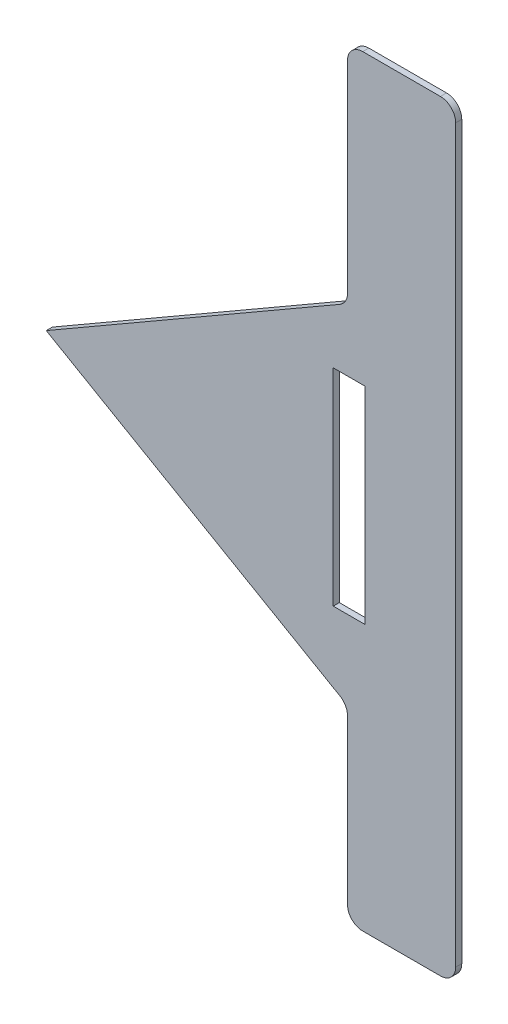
ISO-10303-21;
HEADER;
FILE_DESCRIPTION(('STEP AP214'),'2;1');
FILE_NAME('part.step','',(''),(''),'','','');
FILE_SCHEMA(('AUTOMOTIVE_DESIGN { 1 0 10303 214 1 1 1 1 }'));
ENDSEC;
DATA;
#1=APPLICATION_CONTEXT('core data for automotive mechanical design processes');
#2=APPLICATION_PROTOCOL_DEFINITION('international standard','automotive_design',2000,#1);
#3=PRODUCT_CONTEXT('',#1,'mechanical');
#4=PRODUCT('Part','Part','',(#3));
#5=PRODUCT_RELATED_PRODUCT_CATEGORY('part','',(#4));
#6=PRODUCT_DEFINITION_FORMATION('','',#4);
#7=PRODUCT_DEFINITION_CONTEXT('part definition',#1,'design');
#8=PRODUCT_DEFINITION('design','',#6,#7);
#9=PRODUCT_DEFINITION_SHAPE('','',#8);
#10=(LENGTH_UNIT() NAMED_UNIT(*) SI_UNIT(.MILLI.,.METRE.));
#11=(NAMED_UNIT(*) PLANE_ANGLE_UNIT() SI_UNIT($,.RADIAN.));
#12=(NAMED_UNIT(*) SI_UNIT($,.STERADIAN.) SOLID_ANGLE_UNIT());
#13=UNCERTAINTY_MEASURE_WITH_UNIT(LENGTH_MEASURE(1.E-05),#10,'distance_accuracy_value','');
#14=(GEOMETRIC_REPRESENTATION_CONTEXT(3) GLOBAL_UNCERTAINTY_ASSIGNED_CONTEXT((#13)) GLOBAL_UNIT_ASSIGNED_CONTEXT((#10,
#11,#12)) REPRESENTATION_CONTEXT('',''));
#15=CARTESIAN_POINT('',(0.,0.,0.));
#16=DIRECTION('',(0.,0.,1.));
#17=DIRECTION('',(1.,0.,0.));
#18=AXIS2_PLACEMENT_3D('',#15,#16,#17);
#19=CARTESIAN_POINT('',(0.,0.,-0.8));
#20=DIRECTION('',(0.,0.,-1.));
#21=DIRECTION('',(-1.,0.,0.));
#22=AXIS2_PLACEMENT_3D('',#19,#20,#21);
#23=PLANE('',#22);
#24=DIRECTION('',(1.,0.,0.));
#25=VECTOR('',#24,1.);
#26=CARTESIAN_POINT('',(-15.0000000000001,100.,-0.8));
#27=LINE('',#26,#25);
#28=CARTESIAN_POINT('',(-2.80000000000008,100.,-0.8));
#29=VERTEX_POINT('',#28);
#30=CARTESIAN_POINT('',(-13.0000000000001,100.,-0.8));
#31=VERTEX_POINT('',#30);
#32=EDGE_CURVE('E196',#29,#31,#27,.F.);
#33=ORIENTED_EDGE('',*,*,#32,.F.);
#34=CARTESIAN_POINT('',(-2.80000000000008,98.,-0.8));
#35=DIRECTION('',(0.,0.,1.));
#36=DIRECTION('',(1.,0.,0.));
#37=AXIS2_PLACEMENT_3D('',#34,#35,#36);
#38=CIRCLE('',#37,2.);
#39=CARTESIAN_POINT('',(-0.800000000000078,98.,-0.8));
#40=VERTEX_POINT('',#39);
#41=EDGE_CURVE('E233',#40,#29,#38,.T.);
#42=ORIENTED_EDGE('',*,*,#41,.F.);
#43=DIRECTION('',(0.,1.,0.));
#44=VECTOR('',#43,1.);
#45=CARTESIAN_POINT('',(-0.800000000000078,0.,-0.8));
#46=LINE('',#45,#44);
#47=CARTESIAN_POINT('',(-0.800000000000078,2.,-0.8));
#48=VERTEX_POINT('',#47);
#49=EDGE_CURVE('E192',#48,#40,#46,.T.);
#50=ORIENTED_EDGE('',*,*,#49,.F.);
#51=CARTESIAN_POINT('',(-2.80000000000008,2.,-0.8));
#52=DIRECTION('',(0.,0.,1.));
#53=DIRECTION('',(1.,0.,0.));
#54=AXIS2_PLACEMENT_3D('',#51,#52,#53);
#55=CIRCLE('',#54,2.);
#56=CARTESIAN_POINT('',(-2.80000000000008,0.,-0.8));
#57=VERTEX_POINT('',#56);
#58=EDGE_CURVE('E231',#57,#48,#55,.T.);
#59=ORIENTED_EDGE('',*,*,#58,.F.);
#60=DIRECTION('',(1.,0.,0.));
#61=VECTOR('',#60,1.);
#62=CARTESIAN_POINT('',(-0.800000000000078,0.,-0.8));
#63=LINE('',#62,#61);
#64=CARTESIAN_POINT('',(-13.0000000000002,0.,-0.8));
#65=VERTEX_POINT('',#64);
#66=EDGE_CURVE('E189',#65,#57,#63,.T.);
#67=ORIENTED_EDGE('',*,*,#66,.F.);
#68=CARTESIAN_POINT('',(-13.0000000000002,2.,-0.8));
#69=DIRECTION('',(0.,0.,1.));
#70=DIRECTION('',(1.,0.,0.));
#71=AXIS2_PLACEMENT_3D('',#68,#69,#70);
#72=CIRCLE('',#71,2.);
#73=CARTESIAN_POINT('',(-15.0000000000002,2.,-0.8));
#74=VERTEX_POINT('',#73);
#75=EDGE_CURVE('E20',#74,#65,#72,.T.);
#76=ORIENTED_EDGE('',*,*,#75,.F.);
#77=DIRECTION('',(0.,1.,0.));
#78=VECTOR('',#77,1.);
#79=CARTESIAN_POINT('',(-15.0000000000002,0.,-0.8));
#80=LINE('',#79,#78);
#81=CARTESIAN_POINT('',(-15.0000000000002,23.5071796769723,-0.8));
#82=VERTEX_POINT('',#81);
#83=EDGE_CURVE('E107',#82,#74,#80,.F.);
#84=ORIENTED_EDGE('',*,*,#83,.F.);
#85=CARTESIAN_POINT('',(-17.0000000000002,23.5071796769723,-0.8));
#86=DIRECTION('',(0.,0.,-1.));
#87=DIRECTION('',(-1.,0.,0.));
#88=AXIS2_PLACEMENT_3D('',#85,#86,#87);
#89=CIRCLE('',#88,2.);
#90=CARTESIAN_POINT('',(-16.0000000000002,25.2392304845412,-0.8));
#91=VERTEX_POINT('',#90);
#92=EDGE_CURVE('E150',#82,#91,#89,.F.);
#93=ORIENTED_EDGE('',*,*,#92,.T.);
#94=DIRECTION('',(0.866025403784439,-0.5,0.));
#95=VECTOR('',#94,1.);
#96=CARTESIAN_POINT('',(-15.0000000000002,24.6618802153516,-0.8));
#97=LINE('',#96,#95);
#98=CARTESIAN_POINT('',(-54.5567838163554,47.5000000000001,-0.8));
#99=VERTEX_POINT('',#98);
#100=EDGE_CURVE('E147',#99,#91,#97,.T.);
#101=ORIENTED_EDGE('',*,*,#100,.F.);
#102=DIRECTION('',(-0.866025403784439,-0.5,0.));
#103=VECTOR('',#102,1.);
#104=CARTESIAN_POINT('',(-54.5567838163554,47.5000000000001,-0.8));
#105=LINE('',#104,#103);
#106=CARTESIAN_POINT('',(-16.0000000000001,69.760769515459,-0.8));
#107=VERTEX_POINT('',#106);
#108=EDGE_CURVE('E133',#107,#99,#105,.T.);
#109=ORIENTED_EDGE('',*,*,#108,.F.);
#110=CARTESIAN_POINT('',(-17.0000000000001,71.4928203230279,-0.8));
#111=DIRECTION('',(0.,0.,-1.));
#112=DIRECTION('',(-1.,0.,0.));
#113=AXIS2_PLACEMENT_3D('',#110,#111,#112);
#114=CIRCLE('',#113,2.);
#115=CARTESIAN_POINT('',(-15.0000000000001,71.4928203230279,-0.8));
#116=VERTEX_POINT('',#115);
#117=EDGE_CURVE('E159',#107,#116,#114,.F.);
#118=ORIENTED_EDGE('',*,*,#117,.T.);
#119=DIRECTION('',(0.,-1.,0.));
#120=VECTOR('',#119,1.);
#121=CARTESIAN_POINT('',(-15.0000000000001,70.3381197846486,-0.8));
#122=LINE('',#121,#120);
#123=CARTESIAN_POINT('',(-15.0000000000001,98.,-0.8));
#124=VERTEX_POINT('',#123);
#125=EDGE_CURVE('E200',#124,#116,#122,.T.);
#126=ORIENTED_EDGE('',*,*,#125,.F.);
#127=CARTESIAN_POINT('',(-13.0000000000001,98.,-0.8));
#128=DIRECTION('',(0.,0.,1.));
#129=DIRECTION('',(1.,0.,0.));
#130=AXIS2_PLACEMENT_3D('',#127,#128,#129);
#131=CIRCLE('',#130,2.);
#132=EDGE_CURVE('E235',#31,#124,#131,.T.);
#133=ORIENTED_EDGE('',*,*,#132,.F.);
#134=EDGE_LOOP('',(#33,#42,#50,#59,#67,#76,#84,#93,#101,#109,#118,#126,#133));
#135=FACE_BOUND('',#134,.T.);
#136=DIRECTION('',(1.,0.,0.));
#137=VECTOR('',#136,1.);
#138=CARTESIAN_POINT('',(-16.874669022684,35.0092429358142,-0.8));
#139=LINE('',#138,#137);
#140=CARTESIAN_POINT('',(-16.874669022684,35.0092429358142,-0.8));
#141=VERTEX_POINT('',#140);
#142=CARTESIAN_POINT('',(-12.7110477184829,35.0092429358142,-0.8));
#143=VERTEX_POINT('',#142);
#144=EDGE_CURVE('E187',#141,#143,#139,.T.);
#145=ORIENTED_EDGE('',*,*,#144,.T.);
#146=DIRECTION('',(0.,1.,0.));
#147=VECTOR('',#146,1.);
#148=CARTESIAN_POINT('',(-12.7110477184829,35.0092429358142,-0.8));
#149=LINE('',#148,#147);
#150=CARTESIAN_POINT('',(-12.7110477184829,62.1056181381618,-0.8));
#151=VERTEX_POINT('',#150);
#152=EDGE_CURVE('E182',#143,#151,#149,.T.);
#153=ORIENTED_EDGE('',*,*,#152,.T.);
#154=DIRECTION('',(1.,0.,0.));
#155=VECTOR('',#154,1.);
#156=CARTESIAN_POINT('',(-12.7110477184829,62.1056181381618,-0.8));
#157=LINE('',#156,#155);
#158=CARTESIAN_POINT('',(-16.874669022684,62.1056181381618,-0.8));
#159=VERTEX_POINT('',#158);
#160=EDGE_CURVE('E116',#151,#159,#157,.F.);
#161=ORIENTED_EDGE('',*,*,#160,.T.);
#162=DIRECTION('',(0.,1.,0.));
#163=VECTOR('',#162,1.);
#164=CARTESIAN_POINT('',(-16.874669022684,62.1056181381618,-0.8));
#165=LINE('',#164,#163);
#166=EDGE_CURVE('E170',#159,#141,#165,.F.);
#167=ORIENTED_EDGE('',*,*,#166,.T.);
#168=EDGE_LOOP('',(#145,#153,#161,#167));
#169=FACE_BOUND('',#168,.T.);
#170=ADVANCED_FACE('F17',(#135,#169),#23,.T.);
#171=CARTESIAN_POINT('',(-16.874669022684,35.0092429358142,-10.));
#172=DIRECTION('',(0.,-1.,0.));
#173=DIRECTION('',(0.,0.,-1.));
#174=AXIS2_PLACEMENT_3D('',#171,#172,#173);
#175=PLANE('',#174);
#176=DIRECTION('',(0.,0.,1.));
#177=VECTOR('',#176,1.);
#178=CARTESIAN_POINT('',(-16.874669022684,35.0092429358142,-10.));
#179=LINE('',#178,#177);
#180=CARTESIAN_POINT('',(-16.874669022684,35.0092429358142,0.));
#181=VERTEX_POINT('',#180);
#182=EDGE_CURVE('E175',#141,#181,#179,.T.);
#183=ORIENTED_EDGE('',*,*,#182,.T.);
#184=DIRECTION('',(-1.,0.,0.));
#185=VECTOR('',#184,1.);
#186=CARTESIAN_POINT('',(0.,35.0092429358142,0.));
#187=LINE('',#186,#185);
#188=CARTESIAN_POINT('',(-12.7110477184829,35.0092429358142,0.));
#189=VERTEX_POINT('',#188);
#190=EDGE_CURVE('E256',#181,#189,#187,.F.);
#191=ORIENTED_EDGE('',*,*,#190,.T.);
#192=DIRECTION('',(0.,0.,-1.));
#193=VECTOR('',#192,1.);
#194=CARTESIAN_POINT('',(-12.7110477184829,35.0092429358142,-10.));
#195=LINE('',#194,#193);
#196=EDGE_CURVE('E184',#189,#143,#195,.T.);
#197=ORIENTED_EDGE('',*,*,#196,.T.);
#198=ORIENTED_EDGE('',*,*,#144,.F.);
#199=EDGE_LOOP('',(#183,#191,#197,#198));
#200=FACE_BOUND('',#199,.T.);
#201=ADVANCED_FACE('F460',(#200),#175,.F.);
#202=CARTESIAN_POINT('',(-12.7110477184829,35.0092429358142,-10.));
#203=DIRECTION('',(1.,0.,0.));
#204=DIRECTION('',(0.,0.,-1.));
#205=AXIS2_PLACEMENT_3D('',#202,#203,#204);
#206=PLANE('',#205);
#207=ORIENTED_EDGE('',*,*,#196,.F.);
#208=DIRECTION('',(0.,1.,0.));
#209=VECTOR('',#208,1.);
#210=CARTESIAN_POINT('',(-12.7110477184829,0.,0.));
#211=LINE('',#210,#209);
#212=CARTESIAN_POINT('',(-12.7110477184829,62.1056181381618,0.));
#213=VERTEX_POINT('',#212);
#214=EDGE_CURVE('E260',#189,#213,#211,.T.);
#215=ORIENTED_EDGE('',*,*,#214,.T.);
#216=DIRECTION('',(0.,0.,1.));
#217=VECTOR('',#216,1.);
#218=CARTESIAN_POINT('',(-12.7110477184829,62.1056181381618,-10.));
#219=LINE('',#218,#217);
#220=EDGE_CURVE('E179',#213,#151,#219,.F.);
#221=ORIENTED_EDGE('',*,*,#220,.T.);
#222=ORIENTED_EDGE('',*,*,#152,.F.);
#223=EDGE_LOOP('',(#207,#215,#221,#222));
#224=FACE_BOUND('',#223,.T.);
#225=ADVANCED_FACE('F450',(#224),#206,.F.);
#226=CARTESIAN_POINT('',(-12.7110477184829,62.1056181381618,-10.));
#227=DIRECTION('',(0.,1.,0.));
#228=DIRECTION('',(0.,0.,1.));
#229=AXIS2_PLACEMENT_3D('',#226,#227,#228);
#230=PLANE('',#229);
#231=ORIENTED_EDGE('',*,*,#220,.F.);
#232=DIRECTION('',(-1.,0.,0.));
#233=VECTOR('',#232,1.);
#234=CARTESIAN_POINT('',(0.,62.1056181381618,0.));
#235=LINE('',#234,#233);
#236=CARTESIAN_POINT('',(-16.874669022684,62.1056181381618,0.));
#237=VERTEX_POINT('',#236);
#238=EDGE_CURVE('E263',#213,#237,#235,.T.);
#239=ORIENTED_EDGE('',*,*,#238,.T.);
#240=DIRECTION('',(0.,0.,1.));
#241=VECTOR('',#240,1.);
#242=CARTESIAN_POINT('',(-16.874669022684,62.1056181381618,-10.));
#243=LINE('',#242,#241);
#244=EDGE_CURVE('E172',#237,#159,#243,.F.);
#245=ORIENTED_EDGE('',*,*,#244,.T.);
#246=ORIENTED_EDGE('',*,*,#160,.F.);
#247=EDGE_LOOP('',(#231,#239,#245,#246));
#248=FACE_BOUND('',#247,.T.);
#249=ADVANCED_FACE('F440',(#248),#230,.F.);
#250=CARTESIAN_POINT('',(-16.874669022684,62.1056181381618,-10.));
#251=DIRECTION('',(-1.,0.,0.));
#252=DIRECTION('',(0.,0.,1.));
#253=AXIS2_PLACEMENT_3D('',#250,#251,#252);
#254=PLANE('',#253);
#255=ORIENTED_EDGE('',*,*,#244,.F.);
#256=DIRECTION('',(0.,1.,0.));
#257=VECTOR('',#256,1.);
#258=CARTESIAN_POINT('',(-16.874669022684,0.,0.));
#259=LINE('',#258,#257);
#260=EDGE_CURVE('E230',#237,#181,#259,.F.);
#261=ORIENTED_EDGE('',*,*,#260,.T.);
#262=ORIENTED_EDGE('',*,*,#182,.F.);
#263=ORIENTED_EDGE('',*,*,#166,.F.);
#264=EDGE_LOOP('',(#255,#261,#262,#263));
#265=FACE_BOUND('',#264,.T.);
#266=ADVANCED_FACE('F431',(#265),#254,.F.);
#267=CARTESIAN_POINT('',(-13.0000000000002,2.,-0.8));
#268=DIRECTION('',(0.,0.,1.));
#269=DIRECTION('',(1.,0.,0.));
#270=AXIS2_PLACEMENT_3D('',#267,#268,#269);
#271=CYLINDRICAL_SURFACE('',#270,2.);
#272=CARTESIAN_POINT('',(-13.0000000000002,2.,0.));
#273=DIRECTION('',(0.,0.,1.));
#274=DIRECTION('',(1.,0.,0.));
#275=AXIS2_PLACEMENT_3D('',#272,#273,#274);
#276=CIRCLE('',#275,2.);
#277=CARTESIAN_POINT('',(-13.0000000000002,0.,0.));
#278=VERTEX_POINT('',#277);
#279=CARTESIAN_POINT('',(-15.0000000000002,2.,0.));
#280=VERTEX_POINT('',#279);
#281=EDGE_CURVE('E227',#278,#280,#276,.F.);
#282=ORIENTED_EDGE('',*,*,#281,.T.);
#283=DIRECTION('',(0.,0.,1.));
#284=VECTOR('',#283,1.);
#285=CARTESIAN_POINT('',(-15.0000000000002,2.,-0.8));
#286=LINE('',#285,#284);
#287=EDGE_CURVE('E168',#74,#280,#286,.T.);
#288=ORIENTED_EDGE('',*,*,#287,.F.);
#289=ORIENTED_EDGE('',*,*,#75,.T.);
#290=DIRECTION('',(0.,0.,1.));
#291=VECTOR('',#290,1.);
#292=CARTESIAN_POINT('',(-13.0000000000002,0.,-0.8));
#293=LINE('',#292,#291);
#294=EDGE_CURVE('E253',#278,#65,#293,.F.);
#295=ORIENTED_EDGE('',*,*,#294,.F.);
#296=EDGE_LOOP('',(#282,#288,#289,#295));
#297=FACE_BOUND('',#296,.T.);
#298=ADVANCED_FACE('F310',(#297),#271,.T.);
#299=CARTESIAN_POINT('',(-15.0000000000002,0.,-0.8));
#300=DIRECTION('',(-1.,0.,0.));
#301=DIRECTION('',(0.,0.,1.));
#302=AXIS2_PLACEMENT_3D('',#299,#300,#301);
#303=PLANE('',#302);
#304=DIRECTION('',(0.,1.,0.));
#305=VECTOR('',#304,1.);
#306=CARTESIAN_POINT('',(-15.0000000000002,0.,0.));
#307=LINE('',#306,#305);
#308=CARTESIAN_POINT('',(-15.0000000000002,23.5071796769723,0.));
#309=VERTEX_POINT('',#308);
#310=EDGE_CURVE('E226',#280,#309,#307,.T.);
#311=ORIENTED_EDGE('',*,*,#310,.T.);
#312=DIRECTION('',(0.,0.,-1.));
#313=VECTOR('',#312,1.);
#314=CARTESIAN_POINT('',(-15.0000000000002,23.5071796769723,-0.8));
#315=LINE('',#314,#313);
#316=EDGE_CURVE('E166',#309,#82,#315,.T.);
#317=ORIENTED_EDGE('',*,*,#316,.T.);
#318=ORIENTED_EDGE('',*,*,#83,.T.);
#319=ORIENTED_EDGE('',*,*,#287,.T.);
#320=EDGE_LOOP('',(#311,#317,#318,#319));
#321=FACE_BOUND('',#320,.T.);
#322=ADVANCED_FACE('F306',(#321),#303,.T.);
#323=CARTESIAN_POINT('',(-17.0000000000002,23.5071796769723,-0.8));
#324=DIRECTION('',(0.,0.,-1.));
#325=DIRECTION('',(-1.,0.,0.));
#326=AXIS2_PLACEMENT_3D('',#323,#324,#325);
#327=CYLINDRICAL_SURFACE('',#326,2.);
#328=ORIENTED_EDGE('',*,*,#316,.F.);
#329=CARTESIAN_POINT('',(-17.0000000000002,23.5071796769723,0.));
#330=DIRECTION('',(0.,0.,-1.));
#331=DIRECTION('',(-1.,0.,0.));
#332=AXIS2_PLACEMENT_3D('',#329,#330,#331);
#333=CIRCLE('',#332,2.);
#334=CARTESIAN_POINT('',(-16.0000000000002,25.2392304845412,0.));
#335=VERTEX_POINT('',#334);
#336=EDGE_CURVE('E223',#309,#335,#333,.F.);
#337=ORIENTED_EDGE('',*,*,#336,.T.);
#338=DIRECTION('',(0.,0.,1.));
#339=VECTOR('',#338,1.);
#340=CARTESIAN_POINT('',(-16.0000000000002,25.2392304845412,-0.8));
#341=LINE('',#340,#339);
#342=EDGE_CURVE('E144',#91,#335,#341,.T.);
#343=ORIENTED_EDGE('',*,*,#342,.F.);
#344=ORIENTED_EDGE('',*,*,#92,.F.);
#345=EDGE_LOOP('',(#328,#337,#343,#344));
#346=FACE_BOUND('',#345,.T.);
#347=ADVANCED_FACE('F305',(#346),#327,.F.);
#348=CARTESIAN_POINT('',(-15.0000000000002,24.6618802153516,-0.8));
#349=DIRECTION('',(-0.5,-0.866025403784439,0.));
#350=DIRECTION('',(0.866025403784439,-0.5,0.));
#351=AXIS2_PLACEMENT_3D('',#348,#349,#350);
#352=PLANE('',#351);
#353=DIRECTION('',(-0.866025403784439,0.5,0.));
#354=VECTOR('',#353,1.);
#355=CARTESIAN_POINT('',(-16.0000000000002,25.2392304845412,0.));
#356=LINE('',#355,#354);
#357=CARTESIAN_POINT('',(-54.5567838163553,47.5000000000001,0.));
#358=VERTEX_POINT('',#357);
#359=EDGE_CURVE('E157',#335,#358,#356,.T.);
#360=ORIENTED_EDGE('',*,*,#359,.T.);
#361=DIRECTION('',(0.,0.,1.));
#362=VECTOR('',#361,1.);
#363=CARTESIAN_POINT('',(-54.5567838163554,47.5000000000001,-0.8));
#364=LINE('',#363,#362);
#365=EDGE_CURVE('E138',#99,#358,#364,.T.);
#366=ORIENTED_EDGE('',*,*,#365,.F.);
#367=ORIENTED_EDGE('',*,*,#100,.T.);
#368=ORIENTED_EDGE('',*,*,#342,.T.);
#369=EDGE_LOOP('',(#360,#366,#367,#368));
#370=FACE_BOUND('',#369,.T.);
#371=ADVANCED_FACE('F155',(#370),#352,.T.);
#372=CARTESIAN_POINT('',(-54.5567838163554,47.5000000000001,-0.8));
#373=DIRECTION('',(-0.5,0.866025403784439,0.));
#374=DIRECTION('',(-0.866025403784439,-0.5,0.));
#375=AXIS2_PLACEMENT_3D('',#372,#373,#374);
#376=PLANE('',#375);
#377=ORIENTED_EDGE('',*,*,#108,.T.);
#378=ORIENTED_EDGE('',*,*,#365,.T.);
#379=DIRECTION('',(0.866025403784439,0.5,0.));
#380=VECTOR('',#379,1.);
#381=CARTESIAN_POINT('',(-54.5567838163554,47.5000000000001,0.));
#382=LINE('',#381,#380);
#383=CARTESIAN_POINT('',(-16.0000000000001,69.760769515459,0.));
#384=VERTEX_POINT('',#383);
#385=EDGE_CURVE('E222',#358,#384,#382,.T.);
#386=ORIENTED_EDGE('',*,*,#385,.T.);
#387=DIRECTION('',(0.,0.,-1.));
#388=VECTOR('',#387,1.);
#389=CARTESIAN_POINT('',(-16.0000000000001,69.760769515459,-0.8));
#390=LINE('',#389,#388);
#391=EDGE_CURVE('E140',#384,#107,#390,.T.);
#392=ORIENTED_EDGE('',*,*,#391,.T.);
#393=EDGE_LOOP('',(#377,#378,#386,#392));
#394=FACE_BOUND('',#393,.T.);
#395=ADVANCED_FACE('F135',(#394),#376,.T.);
#396=CARTESIAN_POINT('',(-17.0000000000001,71.4928203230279,-0.8));
#397=DIRECTION('',(0.,0.,-1.));
#398=DIRECTION('',(-1.,0.,0.));
#399=AXIS2_PLACEMENT_3D('',#396,#397,#398);
#400=CYLINDRICAL_SURFACE('',#399,2.);
#401=ORIENTED_EDGE('',*,*,#391,.F.);
#402=CARTESIAN_POINT('',(-17.0000000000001,71.4928203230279,0.));
#403=DIRECTION('',(0.,0.,-1.));
#404=DIRECTION('',(-1.,0.,0.));
#405=AXIS2_PLACEMENT_3D('',#402,#403,#404);
#406=CIRCLE('',#405,2.);
#407=CARTESIAN_POINT('',(-15.0000000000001,71.4928203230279,0.));
#408=VERTEX_POINT('',#407);
#409=EDGE_CURVE('E219',#384,#408,#406,.F.);
#410=ORIENTED_EDGE('',*,*,#409,.T.);
#411=DIRECTION('',(0.,0.,1.));
#412=VECTOR('',#411,1.);
#413=CARTESIAN_POINT('',(-15.0000000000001,71.4928203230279,-0.8));
#414=LINE('',#413,#412);
#415=EDGE_CURVE('E201',#116,#408,#414,.T.);
#416=ORIENTED_EDGE('',*,*,#415,.F.);
#417=ORIENTED_EDGE('',*,*,#117,.F.);
#418=EDGE_LOOP('',(#401,#410,#416,#417));
#419=FACE_BOUND('',#418,.T.);
#420=ADVANCED_FACE('F242',(#419),#400,.F.);
#421=CARTESIAN_POINT('',(-15.0000000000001,70.3381197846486,-0.8));
#422=DIRECTION('',(-1.,0.,0.));
#423=DIRECTION('',(0.,-1.,0.));
#424=AXIS2_PLACEMENT_3D('',#421,#422,#423);
#425=PLANE('',#424);
#426=DIRECTION('',(0.,1.,0.));
#427=VECTOR('',#426,1.);
#428=CARTESIAN_POINT('',(-15.0000000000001,0.,0.));
#429=LINE('',#428,#427);
#430=CARTESIAN_POINT('',(-15.0000000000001,98.,0.));
#431=VERTEX_POINT('',#430);
#432=EDGE_CURVE('E218',#408,#431,#429,.T.);
#433=ORIENTED_EDGE('',*,*,#432,.T.);
#434=DIRECTION('',(0.,0.,1.));
#435=VECTOR('',#434,1.);
#436=CARTESIAN_POINT('',(-15.0000000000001,98.,-0.8));
#437=LINE('',#436,#435);
#438=EDGE_CURVE('E199',#124,#431,#437,.T.);
#439=ORIENTED_EDGE('',*,*,#438,.F.);
#440=ORIENTED_EDGE('',*,*,#125,.T.);
#441=ORIENTED_EDGE('',*,*,#415,.T.);
#442=EDGE_LOOP('',(#433,#439,#440,#441));
#443=FACE_BOUND('',#442,.T.);
#444=ADVANCED_FACE('F301',(#443),#425,.T.);
#445=CARTESIAN_POINT('',(-13.0000000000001,98.,-0.8));
#446=DIRECTION('',(0.,0.,1.));
#447=DIRECTION('',(1.,0.,0.));
#448=AXIS2_PLACEMENT_3D('',#445,#446,#447);
#449=CYLINDRICAL_SURFACE('',#448,2.);
#450=CARTESIAN_POINT('',(-13.0000000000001,98.,0.));
#451=DIRECTION('',(0.,0.,1.));
#452=DIRECTION('',(1.,0.,0.));
#453=AXIS2_PLACEMENT_3D('',#450,#451,#452);
#454=CIRCLE('',#453,2.);
#455=CARTESIAN_POINT('',(-13.0000000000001,100.,0.));
#456=VERTEX_POINT('',#455);
#457=EDGE_CURVE('E215',#431,#456,#454,.F.);
#458=ORIENTED_EDGE('',*,*,#457,.T.);
#459=DIRECTION('',(0.,0.,1.));
#460=VECTOR('',#459,1.);
#461=CARTESIAN_POINT('',(-13.0000000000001,100.,-0.8));
#462=LINE('',#461,#460);
#463=EDGE_CURVE('E198',#31,#456,#462,.T.);
#464=ORIENTED_EDGE('',*,*,#463,.F.);
#465=ORIENTED_EDGE('',*,*,#132,.T.);
#466=ORIENTED_EDGE('',*,*,#438,.T.);
#467=EDGE_LOOP('',(#458,#464,#465,#466));
#468=FACE_BOUND('',#467,.T.);
#469=ADVANCED_FACE('F300',(#468),#449,.T.);
#470=CARTESIAN_POINT('',(-15.0000000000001,100.,-0.8));
#471=DIRECTION('',(0.,1.,0.));
#472=DIRECTION('',(0.,0.,1.));
#473=AXIS2_PLACEMENT_3D('',#470,#471,#472);
#474=PLANE('',#473);
#475=DIRECTION('',(-1.,0.,0.));
#476=VECTOR('',#475,1.);
#477=CARTESIAN_POINT('',(0.,100.,0.));
#478=LINE('',#477,#476);
#479=CARTESIAN_POINT('',(-2.80000000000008,100.,0.));
#480=VERTEX_POINT('',#479);
#481=EDGE_CURVE('E214',#456,#480,#478,.F.);
#482=ORIENTED_EDGE('',*,*,#481,.T.);
#483=DIRECTION('',(0.,0.,1.));
#484=VECTOR('',#483,1.);
#485=CARTESIAN_POINT('',(-2.80000000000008,100.,-0.8));
#486=LINE('',#485,#484);
#487=EDGE_CURVE('E195',#29,#480,#486,.T.);
#488=ORIENTED_EDGE('',*,*,#487,.F.);
#489=ORIENTED_EDGE('',*,*,#32,.T.);
#490=ORIENTED_EDGE('',*,*,#463,.T.);
#491=EDGE_LOOP('',(#482,#488,#489,#490));
#492=FACE_BOUND('',#491,.T.);
#493=ADVANCED_FACE('F296',(#492),#474,.T.);
#494=CARTESIAN_POINT('',(-2.80000000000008,98.,-0.8));
#495=DIRECTION('',(0.,0.,1.));
#496=DIRECTION('',(1.,0.,0.));
#497=AXIS2_PLACEMENT_3D('',#494,#495,#496);
#498=CYLINDRICAL_SURFACE('',#497,2.);
#499=CARTESIAN_POINT('',(-2.80000000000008,98.,0.));
#500=DIRECTION('',(0.,0.,1.));
#501=DIRECTION('',(1.,0.,0.));
#502=AXIS2_PLACEMENT_3D('',#499,#500,#501);
#503=CIRCLE('',#502,2.);
#504=CARTESIAN_POINT('',(-0.800000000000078,98.,0.));
#505=VERTEX_POINT('',#504);
#506=EDGE_CURVE('E211',#480,#505,#503,.F.);
#507=ORIENTED_EDGE('',*,*,#506,.T.);
#508=DIRECTION('',(0.,0.,-1.));
#509=VECTOR('',#508,1.);
#510=CARTESIAN_POINT('',(-0.800000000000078,98.,-0.8));
#511=LINE('',#510,#509);
#512=EDGE_CURVE('E194',#40,#505,#511,.F.);
#513=ORIENTED_EDGE('',*,*,#512,.F.);
#514=ORIENTED_EDGE('',*,*,#41,.T.);
#515=ORIENTED_EDGE('',*,*,#487,.T.);
#516=EDGE_LOOP('',(#507,#513,#514,#515));
#517=FACE_BOUND('',#516,.T.);
#518=ADVANCED_FACE('F292',(#517),#498,.T.);
#519=CARTESIAN_POINT('',(-0.800000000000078,0.,-0.8));
#520=DIRECTION('',(1.,0.,0.));
#521=DIRECTION('',(0.,0.,-1.));
#522=AXIS2_PLACEMENT_3D('',#519,#520,#521);
#523=PLANE('',#522);
#524=ORIENTED_EDGE('',*,*,#49,.T.);
#525=ORIENTED_EDGE('',*,*,#512,.T.);
#526=DIRECTION('',(0.,1.,0.));
#527=VECTOR('',#526,1.);
#528=CARTESIAN_POINT('',(-0.800000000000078,0.,0.));
#529=LINE('',#528,#527);
#530=CARTESIAN_POINT('',(-0.800000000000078,2.,0.));
#531=VERTEX_POINT('',#530);
#532=EDGE_CURVE('E210',#505,#531,#529,.F.);
#533=ORIENTED_EDGE('',*,*,#532,.T.);
#534=DIRECTION('',(0.,0.,1.));
#535=VECTOR('',#534,1.);
#536=CARTESIAN_POINT('',(-0.800000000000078,2.,-0.8));
#537=LINE('',#536,#535);
#538=EDGE_CURVE('E191',#48,#531,#537,.T.);
#539=ORIENTED_EDGE('',*,*,#538,.F.);
#540=EDGE_LOOP('',(#524,#525,#533,#539));
#541=FACE_BOUND('',#540,.T.);
#542=ADVANCED_FACE('F283',(#541),#523,.T.);
#543=CARTESIAN_POINT('',(-2.80000000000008,2.,-0.8));
#544=DIRECTION('',(0.,0.,1.));
#545=DIRECTION('',(1.,0.,0.));
#546=AXIS2_PLACEMENT_3D('',#543,#544,#545);
#547=CYLINDRICAL_SURFACE('',#546,2.);
#548=CARTESIAN_POINT('',(-2.80000000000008,2.,0.));
#549=DIRECTION('',(0.,0.,1.));
#550=DIRECTION('',(1.,0.,0.));
#551=AXIS2_PLACEMENT_3D('',#548,#549,#550);
#552=CIRCLE('',#551,2.);
#553=CARTESIAN_POINT('',(-2.80000000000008,0.,0.));
#554=VERTEX_POINT('',#553);
#555=EDGE_CURVE('E26',#531,#554,#552,.F.);
#556=ORIENTED_EDGE('',*,*,#555,.T.);
#557=DIRECTION('',(0.,0.,1.));
#558=VECTOR('',#557,1.);
#559=CARTESIAN_POINT('',(-2.80000000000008,0.,-0.8));
#560=LINE('',#559,#558);
#561=EDGE_CURVE('E34',#57,#554,#560,.T.);
#562=ORIENTED_EDGE('',*,*,#561,.F.);
#563=ORIENTED_EDGE('',*,*,#58,.T.);
#564=ORIENTED_EDGE('',*,*,#538,.T.);
#565=EDGE_LOOP('',(#556,#562,#563,#564));
#566=FACE_BOUND('',#565,.T.);
#567=ADVANCED_FACE('F315',(#566),#547,.T.);
#568=CARTESIAN_POINT('',(-0.800000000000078,0.,-0.8));
#569=DIRECTION('',(0.,-1.,0.));
#570=DIRECTION('',(1.,0.,0.));
#571=AXIS2_PLACEMENT_3D('',#568,#569,#570);
#572=PLANE('',#571);
#573=DIRECTION('',(-1.,0.,0.));
#574=VECTOR('',#573,1.);
#575=CARTESIAN_POINT('',(0.,0.,0.));
#576=LINE('',#575,#574);
#577=EDGE_CURVE('E11',#554,#278,#576,.T.);
#578=ORIENTED_EDGE('',*,*,#577,.T.);
#579=ORIENTED_EDGE('',*,*,#294,.T.);
#580=ORIENTED_EDGE('',*,*,#66,.T.);
#581=ORIENTED_EDGE('',*,*,#561,.T.);
#582=EDGE_LOOP('',(#578,#579,#580,#581));
#583=FACE_BOUND('',#582,.T.);
#584=ADVANCED_FACE('F313',(#583),#572,.T.);
#585=CARTESIAN_POINT('',(0.,0.,0.));
#586=DIRECTION('',(0.,0.,-1.));
#587=DIRECTION('',(-1.,0.,0.));
#588=AXIS2_PLACEMENT_3D('',#585,#586,#587);
#589=PLANE('',#588);
#590=ORIENTED_EDGE('',*,*,#555,.F.);
#591=ORIENTED_EDGE('',*,*,#532,.F.);
#592=ORIENTED_EDGE('',*,*,#506,.F.);
#593=ORIENTED_EDGE('',*,*,#481,.F.);
#594=ORIENTED_EDGE('',*,*,#457,.F.);
#595=ORIENTED_EDGE('',*,*,#432,.F.);
#596=ORIENTED_EDGE('',*,*,#409,.F.);
#597=ORIENTED_EDGE('',*,*,#385,.F.);
#598=ORIENTED_EDGE('',*,*,#359,.F.);
#599=ORIENTED_EDGE('',*,*,#336,.F.);
#600=ORIENTED_EDGE('',*,*,#310,.F.);
#601=ORIENTED_EDGE('',*,*,#281,.F.);
#602=ORIENTED_EDGE('',*,*,#577,.F.);
#603=EDGE_LOOP('',(#590,#591,#592,#593,#594,#595,#596,#597,#598,#599,#600,#601,#602));
#604=FACE_BOUND('',#603,.T.);
#605=ORIENTED_EDGE('',*,*,#238,.F.);
#606=ORIENTED_EDGE('',*,*,#214,.F.);
#607=ORIENTED_EDGE('',*,*,#190,.F.);
#608=ORIENTED_EDGE('',*,*,#260,.F.);
#609=EDGE_LOOP('',(#605,#606,#607,#608));
#610=FACE_BOUND('',#609,.T.);
#611=ADVANCED_FACE('F288',(#604,#610),#589,.F.);
#612=CLOSED_SHELL('',(#170,#201,#225,#249,#266,#298,#322,#347,#371,#395,#420,#444,#469,#493,
#518,#542,#567,#584,#611));
#613=MANIFOLD_SOLID_BREP('B1',#612);
#614=ADVANCED_BREP_SHAPE_REPRESENTATION('',(#18,#613),#14);
#615=SHAPE_DEFINITION_REPRESENTATION(#9,#614);
ENDSEC;
END-ISO-10303-21;
